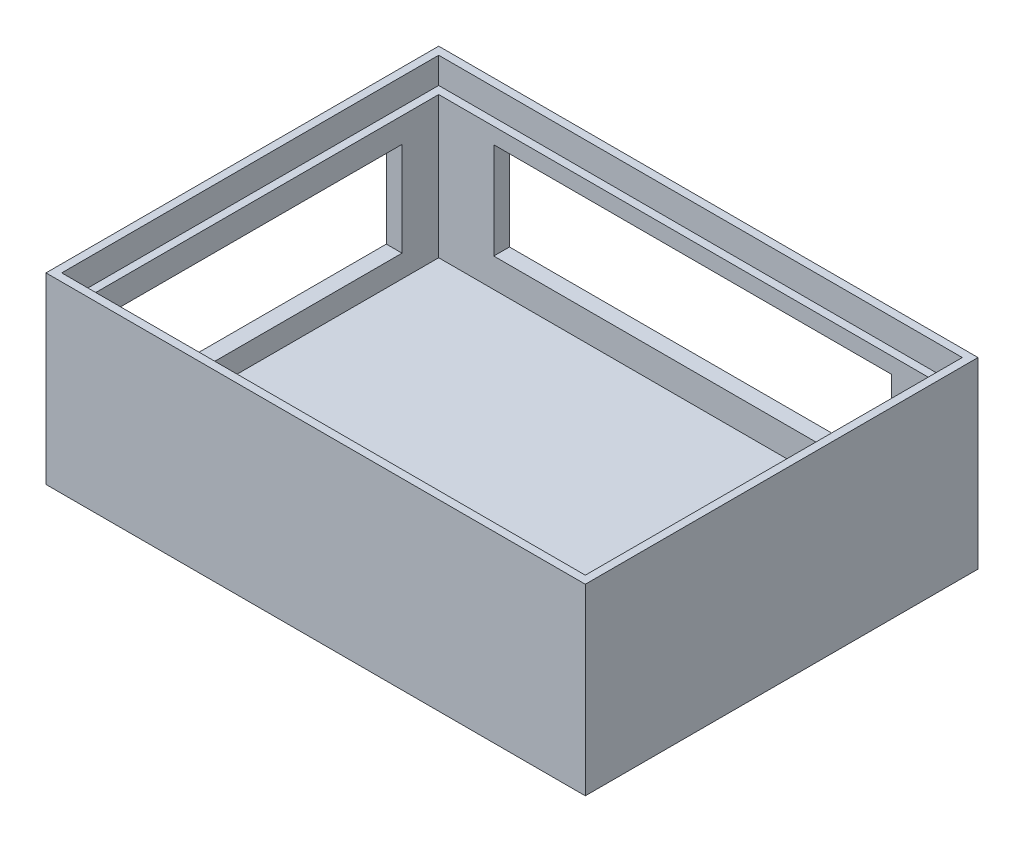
from build123d import *

# Parameters (mm, degrees)
ESQUISSE1_W              = 103
ESQUISSE1_H              = 75
BOSS_EXTRU_1_DEPTH       = 35
COQUE2_T                 = -3
ESQUISSE3_W              = 55
ESQUISSE3_H              = 18
ENL_V_MAT_EXTRU_7_DEPTH  = 31
ESQUISSE10_W             = 75.964874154
ESQUISSE10_H             = 18.415602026
ENL_V_MAT_EXTRU_9_DEPTH  = 10
ESQUISSE11_W             = 100
ESQUISSE11_H             = 72
ENL_V_MAT_EXTRU_12_DEPTH = 5


with BuildPart() as part:
    # Esquisse1 → Boss.-Extru.1 (new body)
    with BuildSketch(Plane(origin=(0, 0, 0), x_dir=(1, 0, 0), z_dir=(0, 1, 0))):
        with Locations((51.5, 37.5)):
            Rectangle(ESQUISSE1_W, ESQUISSE1_H)
    extrude(amount=BOSS_EXTRU_1_DEPTH)

    # Coque2
    coque2_openings = [part.faces().sort_by_distance(p)[0] for p in [
        (51.5, 35, -37.5),
    ]]
    offset(amount=COQUE2_T, openings=coque2_openings, kind=Kind.INTERSECTION)

    # Esquisse3 → Enl_v. mat.-Extru.7 (cut)
    with BuildSketch(Plane(origin=(0, 0, 0), x_dir=(0, 0, -1), z_dir=(1, 0, 0))):
        with Locations((37.5, 16.259058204)):
            Rectangle(ESQUISSE3_W, ESQUISSE3_H)
    extrude(amount=ENL_V_MAT_EXTRU_7_DEPTH, mode=Mode.SUBTRACT)

    # Esquisse10 → Enl_v. mat.-Extru.9 (cut)
    with BuildSketch(Plane(origin=(0, 0, -75), x_dir=(-1, 0, 0), z_dir=(0, 0, -1))):
        with Locations((-51.5, 17.75)):
            Rectangle(ESQUISSE10_W, ESQUISSE10_H)
    extrude(amount=-ENL_V_MAT_EXTRU_9_DEPTH, mode=Mode.SUBTRACT)

    # Esquisse11 → Enl_v. mat.-Extru.12 (cut)
    with BuildSketch(Plane(origin=(0, 35, 0), x_dir=(1, 0, 0), z_dir=(0, 1, 0))):
        with Locations((51.5, 37.5)):
            Rectangle(ESQUISSE11_W, ESQUISSE11_H)
    extrude(amount=-ENL_V_MAT_EXTRU_12_DEPTH, mode=Mode.SUBTRACT)


solid = part.part
